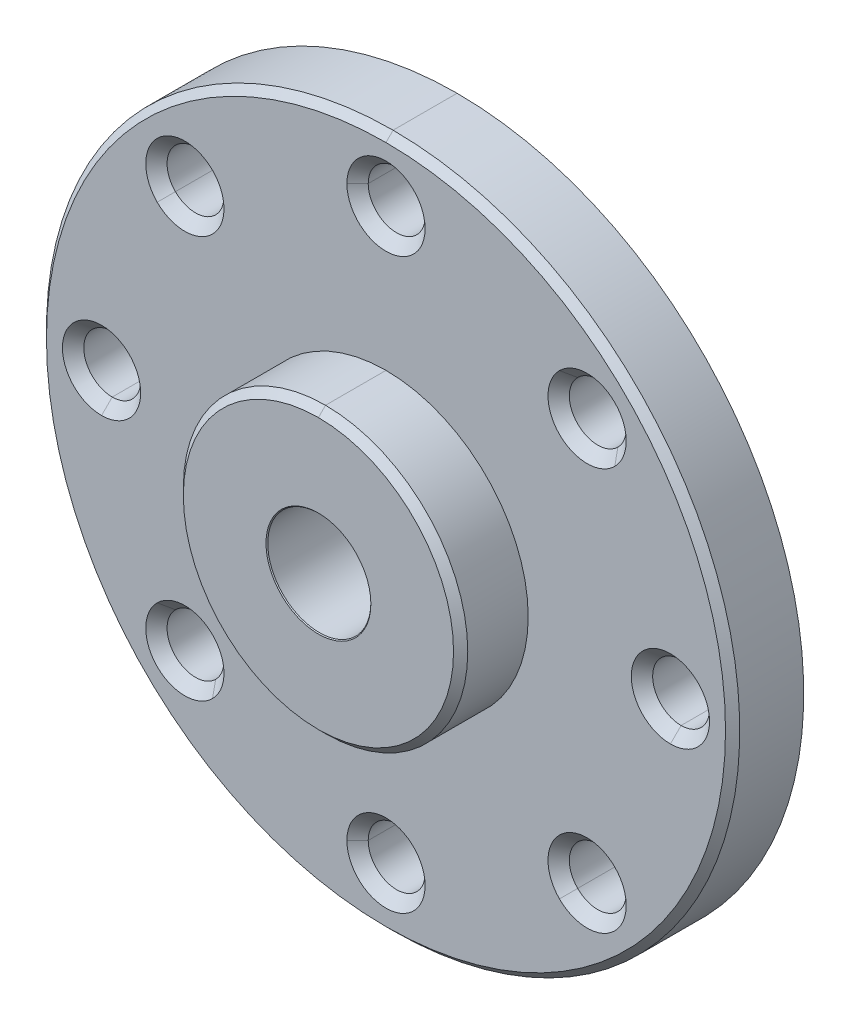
ISO-10303-21;
HEADER;
FILE_DESCRIPTION(('STEP AP214'),'2;1');
FILE_NAME('part.step','',(''),(''),'','','');
FILE_SCHEMA(('AUTOMOTIVE_DESIGN { 1 0 10303 214 1 1 1 1 }'));
ENDSEC;
DATA;
#1=APPLICATION_CONTEXT('core data for automotive mechanical design processes');
#2=APPLICATION_PROTOCOL_DEFINITION('international standard','automotive_design',2000,#1);
#3=PRODUCT_CONTEXT('',#1,'mechanical');
#4=PRODUCT('Part','Part','',(#3));
#5=PRODUCT_RELATED_PRODUCT_CATEGORY('part','',(#4));
#6=PRODUCT_DEFINITION_FORMATION('','',#4);
#7=PRODUCT_DEFINITION_CONTEXT('part definition',#1,'design');
#8=PRODUCT_DEFINITION('design','',#6,#7);
#9=PRODUCT_DEFINITION_SHAPE('','',#8);
#10=(LENGTH_UNIT() NAMED_UNIT(*) SI_UNIT(.MILLI.,.METRE.));
#11=(NAMED_UNIT(*) PLANE_ANGLE_UNIT() SI_UNIT($,.RADIAN.));
#12=(NAMED_UNIT(*) SI_UNIT($,.STERADIAN.) SOLID_ANGLE_UNIT());
#13=UNCERTAINTY_MEASURE_WITH_UNIT(LENGTH_MEASURE(1.E-05),#10,'distance_accuracy_value','');
#14=(GEOMETRIC_REPRESENTATION_CONTEXT(3) GLOBAL_UNCERTAINTY_ASSIGNED_CONTEXT((#13)) GLOBAL_UNIT_ASSIGNED_CONTEXT((#10,
#11,#12)) REPRESENTATION_CONTEXT('',''));
#15=CARTESIAN_POINT('',(0.,0.,0.));
#16=DIRECTION('',(0.,0.,1.));
#17=DIRECTION('',(1.,0.,0.));
#18=AXIS2_PLACEMENT_3D('',#15,#16,#17);
#19=CARTESIAN_POINT('',(0.,-3.799999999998,20.9));
#20=DIRECTION('',(0.,0.,1.));
#21=DIRECTION('',(1.,0.,0.));
#22=AXIS2_PLACEMENT_3D('',#19,#20,#21);
#23=PLANE('',#22);
#24=CARTESIAN_POINT('',(0.,0.,20.9));
#25=DIRECTION('',(0.,0.,1.));
#26=DIRECTION('',(1.,0.,0.));
#27=AXIS2_PLACEMENT_3D('',#24,#25,#26);
#28=CIRCLE('',#27,1.475);
#29=CARTESIAN_POINT('',(1.475,0.,20.9));
#30=VERTEX_POINT('',#29);
#31=EDGE_CURVE('E572',#30,#30,#28,.T.);
#32=ORIENTED_EDGE('',*,*,#31,.F.);
#33=EDGE_LOOP('',(#32));
#34=FACE_BOUND('',#33,.T.);
#35=CARTESIAN_POINT('',(0.,0.,20.9));
#36=DIRECTION('',(0.,0.,-1.));
#37=DIRECTION('',(0.,-1.,0.));
#38=AXIS2_PLACEMENT_3D('',#35,#36,#37);
#39=CIRCLE('',#38,3.799999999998);
#40=CARTESIAN_POINT('',(0.,-3.799999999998,20.9));
#41=VERTEX_POINT('',#40);
#42=CARTESIAN_POINT('',(0.,3.799999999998,20.9));
#43=VERTEX_POINT('',#42);
#44=EDGE_CURVE('E201',#41,#43,#39,.T.);
#45=ORIENTED_EDGE('',*,*,#44,.F.);
#46=CARTESIAN_POINT('',(0.,0.,20.9));
#47=DIRECTION('',(0.,0.,-1.));
#48=DIRECTION('',(0.,1.,0.));
#49=AXIS2_PLACEMENT_3D('',#46,#47,#48);
#50=CIRCLE('',#49,3.799999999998);
#51=EDGE_CURVE('E544',#43,#41,#50,.T.);
#52=ORIENTED_EDGE('',*,*,#51,.F.);
#53=EDGE_LOOP('',(#45,#52));
#54=FACE_BOUND('',#53,.T.);
#55=ADVANCED_FACE('F46',(#34,#54),#23,.T.);
#56=CARTESIAN_POINT('',(-13.85,9.08431457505,17.));
#57=DIRECTION('',(0.,0.,1.));
#58=DIRECTION('',(1.,0.,0.));
#59=AXIS2_PLACEMENT_3D('',#56,#57,#58);
#60=PLANE('',#59);
#61=CARTESIAN_POINT('',(0.,0.,17.));
#62=DIRECTION('',(0.,0.,1.));
#63=DIRECTION('',(1.,0.,0.));
#64=AXIS2_PLACEMENT_3D('',#61,#62,#63);
#65=CIRCLE('',#64,1.45);
#66=CARTESIAN_POINT('',(1.45,0.,17.));
#67=VERTEX_POINT('',#66);
#68=EDGE_CURVE('E49',#67,#67,#65,.T.);
#69=ORIENTED_EDGE('',*,*,#68,.T.);
#70=EDGE_LOOP('',(#69));
#71=FACE_BOUND('',#70,.T.);
#72=CARTESIAN_POINT('',(0.,0.,17.));
#73=DIRECTION('',(0.,0.,1.));
#74=DIRECTION('',(0.,-1.,0.));
#75=AXIS2_PLACEMENT_3D('',#72,#73,#74);
#76=CIRCLE('',#75,9.75);
#77=CARTESIAN_POINT('',(0.,-9.75,17.));
#78=VERTEX_POINT('',#77);
#79=CARTESIAN_POINT('',(0.,9.75,17.));
#80=VERTEX_POINT('',#79);
#81=EDGE_CURVE('E56',#78,#80,#76,.T.);
#82=ORIENTED_EDGE('',*,*,#81,.F.);
#83=CARTESIAN_POINT('',(0.,0.,17.));
#84=DIRECTION('',(0.,0.,1.));
#85=DIRECTION('',(0.,1.,0.));
#86=AXIS2_PLACEMENT_3D('',#83,#84,#85);
#87=CIRCLE('',#86,9.75);
#88=EDGE_CURVE('E11',#80,#78,#87,.T.);
#89=ORIENTED_EDGE('',*,*,#88,.F.);
#90=EDGE_LOOP('',(#82,#89));
#91=FACE_BOUND('',#90,.T.);
#92=CARTESIAN_POINT('',(0.,8.,17.));
#93=DIRECTION('',(0.,0.,-1.));
#94=DIRECTION('',(-1.,0.,0.));
#95=AXIS2_PLACEMENT_3D('',#92,#93,#94);
#96=CIRCLE('',#95,0.8);
#97=CARTESIAN_POINT('',(-0.8,8.,17.));
#98=VERTEX_POINT('',#97);
#99=CARTESIAN_POINT('',(0.8,8.,17.));
#100=VERTEX_POINT('',#99);
#101=EDGE_CURVE('E297',#98,#100,#96,.T.);
#102=ORIENTED_EDGE('',*,*,#101,.F.);
#103=CARTESIAN_POINT('',(0.,8.,17.));
#104=DIRECTION('',(0.,0.,-1.));
#105=DIRECTION('',(1.,0.,0.));
#106=AXIS2_PLACEMENT_3D('',#103,#104,#105);
#107=CIRCLE('',#106,0.8);
#108=EDGE_CURVE('E285',#100,#98,#107,.T.);
#109=ORIENTED_EDGE('',*,*,#108,.F.);
#110=EDGE_LOOP('',(#102,#109));
#111=FACE_BOUND('',#110,.T.);
#112=CARTESIAN_POINT('',(-5.656854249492,5.656854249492,17.));
#113=DIRECTION('',(0.,0.,-1.));
#114=DIRECTION('',(-0.707106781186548,-0.707106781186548,0.));
#115=AXIS2_PLACEMENT_3D('',#112,#113,#114);
#116=CIRCLE('',#115,0.8);
#117=CARTESIAN_POINT('',(-6.222539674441,5.091168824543,17.));
#118=VERTEX_POINT('',#117);
#119=CARTESIAN_POINT('',(-5.091168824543,6.222539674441,17.));
#120=VERTEX_POINT('',#119);
#121=EDGE_CURVE('E335',#118,#120,#116,.T.);
#122=ORIENTED_EDGE('',*,*,#121,.F.);
#123=CARTESIAN_POINT('',(-5.656854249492,5.656854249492,17.));
#124=DIRECTION('',(0.,0.,-1.));
#125=DIRECTION('',(0.707106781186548,0.707106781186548,0.));
#126=AXIS2_PLACEMENT_3D('',#123,#124,#125);
#127=CIRCLE('',#126,0.8);
#128=EDGE_CURVE('E340',#120,#118,#127,.T.);
#129=ORIENTED_EDGE('',*,*,#128,.F.);
#130=EDGE_LOOP('',(#122,#129));
#131=FACE_BOUND('',#130,.T.);
#132=CARTESIAN_POINT('',(-8.,0.,17.));
#133=DIRECTION('',(0.,0.,-1.));
#134=DIRECTION('',(0.,-1.,0.));
#135=AXIS2_PLACEMENT_3D('',#132,#133,#134);
#136=CIRCLE('',#135,0.8);
#137=CARTESIAN_POINT('',(-8.,-0.8,17.));
#138=VERTEX_POINT('',#137);
#139=CARTESIAN_POINT('',(-8.,0.8,17.));
#140=VERTEX_POINT('',#139);
#141=EDGE_CURVE('E389',#138,#140,#136,.T.);
#142=ORIENTED_EDGE('',*,*,#141,.F.);
#143=CARTESIAN_POINT('',(-8.,0.,17.));
#144=DIRECTION('',(0.,0.,-1.));
#145=DIRECTION('',(0.,1.,0.));
#146=AXIS2_PLACEMENT_3D('',#143,#144,#145);
#147=CIRCLE('',#146,0.8);
#148=EDGE_CURVE('E358',#140,#138,#147,.T.);
#149=ORIENTED_EDGE('',*,*,#148,.F.);
#150=EDGE_LOOP('',(#142,#149));
#151=FACE_BOUND('',#150,.T.);
#152=CARTESIAN_POINT('',(-5.656854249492,-5.656854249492,17.));
#153=DIRECTION('',(0.,0.,-1.));
#154=DIRECTION('',(0.707106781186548,-0.707106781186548,0.));
#155=AXIS2_PLACEMENT_3D('',#152,#153,#154);
#156=CIRCLE('',#155,0.8);
#157=CARTESIAN_POINT('',(-5.091168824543,-6.222539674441,17.));
#158=VERTEX_POINT('',#157);
#159=CARTESIAN_POINT('',(-6.222539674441,-5.091168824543,17.));
#160=VERTEX_POINT('',#159);
#161=EDGE_CURVE('E227',#158,#160,#156,.T.);
#162=ORIENTED_EDGE('',*,*,#161,.F.);
#163=CARTESIAN_POINT('',(-5.656854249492,-5.656854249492,17.));
#164=DIRECTION('',(0.,0.,-1.));
#165=DIRECTION('',(-0.707106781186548,0.707106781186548,0.));
#166=AXIS2_PLACEMENT_3D('',#163,#164,#165);
#167=CIRCLE('',#166,0.8);
#168=EDGE_CURVE('E223',#160,#158,#167,.T.);
#169=ORIENTED_EDGE('',*,*,#168,.F.);
#170=EDGE_LOOP('',(#162,#169));
#171=FACE_BOUND('',#170,.T.);
#172=CARTESIAN_POINT('',(0.,-8.,17.));
#173=DIRECTION('',(0.,0.,-1.));
#174=DIRECTION('',(1.,0.,0.));
#175=AXIS2_PLACEMENT_3D('',#172,#173,#174);
#176=CIRCLE('',#175,0.8);
#177=CARTESIAN_POINT('',(0.8,-8.,17.));
#178=VERTEX_POINT('',#177);
#179=CARTESIAN_POINT('',(-0.8,-8.,17.));
#180=VERTEX_POINT('',#179);
#181=EDGE_CURVE('E444',#178,#180,#176,.T.);
#182=ORIENTED_EDGE('',*,*,#181,.F.);
#183=CARTESIAN_POINT('',(0.,-8.,17.));
#184=DIRECTION('',(0.,0.,-1.));
#185=DIRECTION('',(-1.,0.,0.));
#186=AXIS2_PLACEMENT_3D('',#183,#184,#185);
#187=CIRCLE('',#186,0.8);
#188=EDGE_CURVE('E441',#180,#178,#187,.T.);
#189=ORIENTED_EDGE('',*,*,#188,.F.);
#190=EDGE_LOOP('',(#182,#189));
#191=FACE_BOUND('',#190,.T.);
#192=CARTESIAN_POINT('',(5.656854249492,-5.656854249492,17.));
#193=DIRECTION('',(0.,0.,-1.));
#194=DIRECTION('',(0.707106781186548,0.707106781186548,0.));
#195=AXIS2_PLACEMENT_3D('',#192,#193,#194);
#196=CIRCLE('',#195,0.8);
#197=CARTESIAN_POINT('',(6.222539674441,-5.091168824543,17.));
#198=VERTEX_POINT('',#197);
#199=CARTESIAN_POINT('',(5.091168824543,-6.222539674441,17.));
#200=VERTEX_POINT('',#199);
#201=EDGE_CURVE('E433',#198,#200,#196,.T.);
#202=ORIENTED_EDGE('',*,*,#201,.F.);
#203=CARTESIAN_POINT('',(5.656854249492,-5.656854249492,17.));
#204=DIRECTION('',(0.,0.,-1.));
#205=DIRECTION('',(-0.707106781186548,-0.707106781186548,0.));
#206=AXIS2_PLACEMENT_3D('',#203,#204,#205);
#207=CIRCLE('',#206,0.8);
#208=EDGE_CURVE('E430',#200,#198,#207,.T.);
#209=ORIENTED_EDGE('',*,*,#208,.F.);
#210=EDGE_LOOP('',(#202,#209));
#211=FACE_BOUND('',#210,.T.);
#212=CARTESIAN_POINT('',(8.,0.,17.));
#213=DIRECTION('',(0.,0.,-1.));
#214=DIRECTION('',(0.,1.,0.));
#215=AXIS2_PLACEMENT_3D('',#212,#213,#214);
#216=CIRCLE('',#215,0.8);
#217=CARTESIAN_POINT('',(8.,0.8,17.));
#218=VERTEX_POINT('',#217);
#219=CARTESIAN_POINT('',(8.,-0.8,17.));
#220=VERTEX_POINT('',#219);
#221=EDGE_CURVE('E401',#218,#220,#216,.T.);
#222=ORIENTED_EDGE('',*,*,#221,.F.);
#223=CARTESIAN_POINT('',(8.,0.,17.));
#224=DIRECTION('',(0.,0.,-1.));
#225=DIRECTION('',(0.,-1.,0.));
#226=AXIS2_PLACEMENT_3D('',#223,#224,#225);
#227=CIRCLE('',#226,0.8);
#228=EDGE_CURVE('E295',#220,#218,#227,.T.);
#229=ORIENTED_EDGE('',*,*,#228,.F.);
#230=EDGE_LOOP('',(#222,#229));
#231=FACE_BOUND('',#230,.T.);
#232=CARTESIAN_POINT('',(5.656854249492,5.656854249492,17.));
#233=DIRECTION('',(0.,0.,-1.));
#234=DIRECTION('',(-0.707106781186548,0.707106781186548,0.));
#235=AXIS2_PLACEMENT_3D('',#232,#233,#234);
#236=CIRCLE('',#235,0.8);
#237=CARTESIAN_POINT('',(5.091168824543,6.222539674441,17.));
#238=VERTEX_POINT('',#237);
#239=CARTESIAN_POINT('',(6.222539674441,5.091168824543,17.));
#240=VERTEX_POINT('',#239);
#241=EDGE_CURVE('E334',#238,#240,#236,.T.);
#242=ORIENTED_EDGE('',*,*,#241,.F.);
#243=CARTESIAN_POINT('',(5.656854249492,5.656854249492,17.));
#244=DIRECTION('',(0.,0.,-1.));
#245=DIRECTION('',(0.707106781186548,-0.707106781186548,0.));
#246=AXIS2_PLACEMENT_3D('',#243,#244,#245);
#247=CIRCLE('',#246,0.8);
#248=EDGE_CURVE('E484',#240,#238,#247,.T.);
#249=ORIENTED_EDGE('',*,*,#248,.F.);
#250=EDGE_LOOP('',(#242,#249));
#251=FACE_BOUND('',#250,.T.);
#252=ADVANCED_FACE('F225',(#71,#91,#111,#131,#151,#171,#191,#211,#231,#251),#60,.F.);
#253=CARTESIAN_POINT('',(0.,0.,21.35));
#254=DIRECTION('',(0.,0.,-1.));
#255=DIRECTION('',(0.,-1.,0.));
#256=AXIS2_PLACEMENT_3D('',#253,#254,#255);
#257=CYLINDRICAL_SURFACE('',#256,9.75);
#258=DIRECTION('',(0.,-1.42108547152E-13,-1.));
#259=VECTOR('',#258,1.);
#260=CARTESIAN_POINT('',(0.,-9.75,18.8));
#261=LINE('',#260,#259);
#262=CARTESIAN_POINT('',(0.,-9.749999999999,18.8));
#263=VERTEX_POINT('',#262);
#264=EDGE_CURVE('E276',#263,#78,#261,.T.);
#265=ORIENTED_EDGE('',*,*,#264,.T.);
#266=ORIENTED_EDGE('',*,*,#81,.T.);
#267=DIRECTION('',(-9.817297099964E-10,1.42108547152E-13,-1.));
#268=VECTOR('',#267,1.);
#269=CARTESIAN_POINT('',(2.946999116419E-09,9.75,18.8));
#270=LINE('',#269,#268);
#271=CARTESIAN_POINT('',(1.76982875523E-09,9.749999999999,18.8));
#272=VERTEX_POINT('',#271);
#273=EDGE_CURVE('E280',#272,#80,#270,.T.);
#274=ORIENTED_EDGE('',*,*,#273,.F.);
#275=CARTESIAN_POINT('',(0.,0.,18.8));
#276=DIRECTION('',(0.,0.,-1.));
#277=DIRECTION('',(1.815208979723E-10,1.,0.));
#278=AXIS2_PLACEMENT_3D('',#275,#276,#277);
#279=CIRCLE('',#278,9.749999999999);
#280=EDGE_CURVE('E407',#272,#263,#279,.T.);
#281=ORIENTED_EDGE('',*,*,#280,.T.);
#282=EDGE_LOOP('',(#265,#266,#274,#281));
#283=FACE_BOUND('',#282,.T.);
#284=ADVANCED_FACE('F688',(#283),#257,.T.);
#285=CARTESIAN_POINT('',(0.,0.,21.35));
#286=DIRECTION('',(0.,0.,-1.));
#287=DIRECTION('',(0.,-1.,0.));
#288=AXIS2_PLACEMENT_3D('',#285,#286,#287);
#289=CYLINDRICAL_SURFACE('',#288,9.75);
#290=ORIENTED_EDGE('',*,*,#273,.T.);
#291=ORIENTED_EDGE('',*,*,#88,.T.);
#292=ORIENTED_EDGE('',*,*,#264,.F.);
#293=CARTESIAN_POINT('',(0.,0.,18.8));
#294=DIRECTION('',(0.,0.,-1.));
#295=DIRECTION('',(0.,-1.,0.));
#296=AXIS2_PLACEMENT_3D('',#293,#294,#295);
#297=CIRCLE('',#296,9.749999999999);
#298=EDGE_CURVE('E387',#263,#272,#297,.T.);
#299=ORIENTED_EDGE('',*,*,#298,.T.);
#300=EDGE_LOOP('',(#290,#291,#292,#299));
#301=FACE_BOUND('',#300,.T.);
#302=ADVANCED_FACE('F687',(#301),#289,.T.);
#303=CARTESIAN_POINT('',(0.,8.,16.39527708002));
#304=DIRECTION('',(0.,0.,1.));
#305=DIRECTION('',(-1.,0.,0.));
#306=AXIS2_PLACEMENT_3D('',#303,#304,#305);
#307=CYLINDRICAL_SURFACE('',#306,0.8);
#308=DIRECTION('',(0.,0.,-1.));
#309=VECTOR('',#308,1.);
#310=CARTESIAN_POINT('',(-0.8,8.,18.7));
#311=LINE('',#310,#309);
#312=CARTESIAN_POINT('',(-0.8,8.,18.7));
#313=VERTEX_POINT('',#312);
#314=EDGE_CURVE('E301',#313,#98,#311,.T.);
#315=ORIENTED_EDGE('',*,*,#314,.F.);
#316=CARTESIAN_POINT('',(0.,8.,18.7));
#317=DIRECTION('',(0.,0.,1.));
#318=DIRECTION('',(-1.,0.,0.));
#319=AXIS2_PLACEMENT_3D('',#316,#317,#318);
#320=CIRCLE('',#319,0.8);
#321=CARTESIAN_POINT('',(0.8,8.,18.7));
#322=VERTEX_POINT('',#321);
#323=EDGE_CURVE('E388',#313,#322,#320,.T.);
#324=ORIENTED_EDGE('',*,*,#323,.T.);
#325=DIRECTION('',(0.,0.,-1.));
#326=VECTOR('',#325,1.);
#327=CARTESIAN_POINT('',(0.8,8.,18.7));
#328=LINE('',#327,#326);
#329=EDGE_CURVE('E275',#322,#100,#328,.T.);
#330=ORIENTED_EDGE('',*,*,#329,.T.);
#331=ORIENTED_EDGE('',*,*,#108,.T.);
#332=EDGE_LOOP('',(#315,#324,#330,#331));
#333=FACE_BOUND('',#332,.T.);
#334=ADVANCED_FACE('F804',(#333),#307,.F.);
#335=CARTESIAN_POINT('',(0.,8.,16.39527708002));
#336=DIRECTION('',(0.,0.,1.));
#337=DIRECTION('',(-1.,0.,0.));
#338=AXIS2_PLACEMENT_3D('',#335,#336,#337);
#339=CYLINDRICAL_SURFACE('',#338,0.8);
#340=ORIENTED_EDGE('',*,*,#329,.F.);
#341=CARTESIAN_POINT('',(0.,8.,18.7));
#342=DIRECTION('',(0.,0.,1.));
#343=DIRECTION('',(1.,0.,0.));
#344=AXIS2_PLACEMENT_3D('',#341,#342,#343);
#345=CIRCLE('',#344,0.8);
#346=EDGE_CURVE('E270',#322,#313,#345,.T.);
#347=ORIENTED_EDGE('',*,*,#346,.T.);
#348=ORIENTED_EDGE('',*,*,#314,.T.);
#349=ORIENTED_EDGE('',*,*,#101,.T.);
#350=EDGE_LOOP('',(#340,#347,#348,#349));
#351=FACE_BOUND('',#350,.T.);
#352=ADVANCED_FACE('F801',(#351),#339,.F.);
#353=CARTESIAN_POINT('',(-5.656854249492,5.656854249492,16.39527708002));
#354=DIRECTION('',(0.,0.,1.));
#355=DIRECTION('',(-0.707106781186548,-0.707106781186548,0.));
#356=AXIS2_PLACEMENT_3D('',#353,#354,#355);
#357=CYLINDRICAL_SURFACE('',#356,0.8);
#358=DIRECTION('',(0.,0.,-1.));
#359=VECTOR('',#358,1.);
#360=CARTESIAN_POINT('',(-6.222539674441,5.091168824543,18.7));
#361=LINE('',#360,#359);
#362=CARTESIAN_POINT('',(-6.222539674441,5.091168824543,18.7));
#363=VERTEX_POINT('',#362);
#364=EDGE_CURVE('E339',#363,#118,#361,.T.);
#365=ORIENTED_EDGE('',*,*,#364,.F.);
#366=CARTESIAN_POINT('',(-5.656854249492,5.656854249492,18.7));
#367=DIRECTION('',(0.,0.,1.));
#368=DIRECTION('',(-0.707106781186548,-0.707106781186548,0.));
#369=AXIS2_PLACEMENT_3D('',#366,#367,#368);
#370=CIRCLE('',#369,0.8);
#371=CARTESIAN_POINT('',(-5.091168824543,6.222539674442,18.7));
#372=VERTEX_POINT('',#371);
#373=EDGE_CURVE('E286',#363,#372,#370,.T.);
#374=ORIENTED_EDGE('',*,*,#373,.T.);
#375=DIRECTION('',(0.,0.,-1.));
#376=VECTOR('',#375,1.);
#377=CARTESIAN_POINT('',(-5.091168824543,6.222539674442,18.7));
#378=LINE('',#377,#376);
#379=EDGE_CURVE('E394',#372,#120,#378,.T.);
#380=ORIENTED_EDGE('',*,*,#379,.T.);
#381=ORIENTED_EDGE('',*,*,#128,.T.);
#382=EDGE_LOOP('',(#365,#374,#380,#381));
#383=FACE_BOUND('',#382,.T.);
#384=ADVANCED_FACE('F756',(#383),#357,.F.);
#385=CARTESIAN_POINT('',(-5.656854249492,5.656854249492,16.39527708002));
#386=DIRECTION('',(0.,0.,1.));
#387=DIRECTION('',(-0.707106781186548,-0.707106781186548,0.));
#388=AXIS2_PLACEMENT_3D('',#385,#386,#387);
#389=CYLINDRICAL_SURFACE('',#388,0.8);
#390=ORIENTED_EDGE('',*,*,#379,.F.);
#391=CARTESIAN_POINT('',(-5.656854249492,5.656854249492,18.7));
#392=DIRECTION('',(0.,0.,1.));
#393=DIRECTION('',(0.707106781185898,0.707106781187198,0.));
#394=AXIS2_PLACEMENT_3D('',#391,#392,#393);
#395=CIRCLE('',#394,0.8);
#396=EDGE_CURVE('E398',#372,#363,#395,.T.);
#397=ORIENTED_EDGE('',*,*,#396,.T.);
#398=ORIENTED_EDGE('',*,*,#364,.T.);
#399=ORIENTED_EDGE('',*,*,#121,.T.);
#400=EDGE_LOOP('',(#390,#397,#398,#399));
#401=FACE_BOUND('',#400,.T.);
#402=ADVANCED_FACE('F763',(#401),#389,.F.);
#403=CARTESIAN_POINT('',(-8.,0.,16.39527708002));
#404=DIRECTION('',(0.,0.,1.));
#405=DIRECTION('',(0.,-1.,0.));
#406=AXIS2_PLACEMENT_3D('',#403,#404,#405);
#407=CYLINDRICAL_SURFACE('',#406,0.8);
#408=DIRECTION('',(0.,0.,-1.));
#409=VECTOR('',#408,1.);
#410=CARTESIAN_POINT('',(-8.,-0.8,18.7));
#411=LINE('',#410,#409);
#412=CARTESIAN_POINT('',(-8.,-0.8,18.7));
#413=VERTEX_POINT('',#412);
#414=EDGE_CURVE('E393',#413,#138,#411,.T.);
#415=ORIENTED_EDGE('',*,*,#414,.F.);
#416=CARTESIAN_POINT('',(-8.,0.,18.7));
#417=DIRECTION('',(0.,0.,1.));
#418=DIRECTION('',(0.,-1.,0.));
#419=AXIS2_PLACEMENT_3D('',#416,#417,#418);
#420=CIRCLE('',#419,0.8);
#421=CARTESIAN_POINT('',(-8.,0.8,18.7));
#422=VERTEX_POINT('',#421);
#423=EDGE_CURVE('E262',#413,#422,#420,.T.);
#424=ORIENTED_EDGE('',*,*,#423,.T.);
#425=DIRECTION('',(0.,0.,-1.));
#426=VECTOR('',#425,1.);
#427=CARTESIAN_POINT('',(-8.,0.8,18.7));
#428=LINE('',#427,#426);
#429=EDGE_CURVE('E522',#422,#140,#428,.T.);
#430=ORIENTED_EDGE('',*,*,#429,.T.);
#431=ORIENTED_EDGE('',*,*,#148,.T.);
#432=EDGE_LOOP('',(#415,#424,#430,#431));
#433=FACE_BOUND('',#432,.T.);
#434=ADVANCED_FACE('F656',(#433),#407,.F.);
#435=CARTESIAN_POINT('',(-8.,0.,16.39527708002));
#436=DIRECTION('',(0.,0.,1.));
#437=DIRECTION('',(0.,-1.,0.));
#438=AXIS2_PLACEMENT_3D('',#435,#436,#437);
#439=CYLINDRICAL_SURFACE('',#438,0.8);
#440=ORIENTED_EDGE('',*,*,#429,.F.);
#441=CARTESIAN_POINT('',(-8.,0.,18.7));
#442=DIRECTION('',(0.,0.,1.));
#443=DIRECTION('',(0.,1.,0.));
#444=AXIS2_PLACEMENT_3D('',#441,#442,#443);
#445=CIRCLE('',#444,0.8);
#446=EDGE_CURVE('E263',#422,#413,#445,.T.);
#447=ORIENTED_EDGE('',*,*,#446,.T.);
#448=ORIENTED_EDGE('',*,*,#414,.T.);
#449=ORIENTED_EDGE('',*,*,#141,.T.);
#450=EDGE_LOOP('',(#440,#447,#448,#449));
#451=FACE_BOUND('',#450,.T.);
#452=ADVANCED_FACE('F661',(#451),#439,.F.);
#453=CARTESIAN_POINT('',(-5.656854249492,-5.656854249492,16.39527708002));
#454=DIRECTION('',(0.,0.,1.));
#455=DIRECTION('',(0.707106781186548,-0.707106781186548,0.));
#456=AXIS2_PLACEMENT_3D('',#453,#454,#455);
#457=CYLINDRICAL_SURFACE('',#456,0.8);
#458=DIRECTION('',(0.,0.,-1.));
#459=VECTOR('',#458,1.);
#460=CARTESIAN_POINT('',(-5.091168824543,-6.222539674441,18.7));
#461=LINE('',#460,#459);
#462=CARTESIAN_POINT('',(-5.091168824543,-6.222539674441,18.7));
#463=VERTEX_POINT('',#462);
#464=EDGE_CURVE('E239',#463,#158,#461,.T.);
#465=ORIENTED_EDGE('',*,*,#464,.F.);
#466=CARTESIAN_POINT('',(-5.656854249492,-5.656854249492,18.7));
#467=DIRECTION('',(0.,0.,1.));
#468=DIRECTION('',(0.707106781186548,-0.707106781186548,0.));
#469=AXIS2_PLACEMENT_3D('',#466,#467,#468);
#470=CIRCLE('',#469,0.8);
#471=CARTESIAN_POINT('',(-6.222539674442,-5.091168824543,18.7));
#472=VERTEX_POINT('',#471);
#473=EDGE_CURVE('E245',#463,#472,#470,.T.);
#474=ORIENTED_EDGE('',*,*,#473,.T.);
#475=DIRECTION('',(0.,0.,-1.));
#476=VECTOR('',#475,1.);
#477=CARTESIAN_POINT('',(-6.222539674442,-5.091168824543,18.7));
#478=LINE('',#477,#476);
#479=EDGE_CURVE('E237',#472,#160,#478,.T.);
#480=ORIENTED_EDGE('',*,*,#479,.T.);
#481=ORIENTED_EDGE('',*,*,#168,.T.);
#482=EDGE_LOOP('',(#465,#474,#480,#481));
#483=FACE_BOUND('',#482,.T.);
#484=ADVANCED_FACE('F243',(#483),#457,.F.);
#485=CARTESIAN_POINT('',(-5.656854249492,-5.656854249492,16.39527708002));
#486=DIRECTION('',(0.,0.,1.));
#487=DIRECTION('',(0.707106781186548,-0.707106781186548,0.));
#488=AXIS2_PLACEMENT_3D('',#485,#486,#487);
#489=CYLINDRICAL_SURFACE('',#488,0.8);
#490=ORIENTED_EDGE('',*,*,#479,.F.);
#491=CARTESIAN_POINT('',(-5.656854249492,-5.656854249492,18.7));
#492=DIRECTION('',(0.,0.,1.));
#493=DIRECTION('',(-0.707106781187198,0.707106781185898,0.));
#494=AXIS2_PLACEMENT_3D('',#491,#492,#493);
#495=CIRCLE('',#494,0.8);
#496=EDGE_CURVE('E248',#472,#463,#495,.T.);
#497=ORIENTED_EDGE('',*,*,#496,.T.);
#498=ORIENTED_EDGE('',*,*,#464,.T.);
#499=ORIENTED_EDGE('',*,*,#161,.T.);
#500=EDGE_LOOP('',(#490,#497,#498,#499));
#501=FACE_BOUND('',#500,.T.);
#502=ADVANCED_FACE('F235',(#501),#489,.F.);
#503=CARTESIAN_POINT('',(0.,-8.,16.39527708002));
#504=DIRECTION('',(0.,0.,1.));
#505=DIRECTION('',(1.,0.,0.));
#506=AXIS2_PLACEMENT_3D('',#503,#504,#505);
#507=CYLINDRICAL_SURFACE('',#506,0.8);
#508=DIRECTION('',(0.,0.,-1.));
#509=VECTOR('',#508,1.);
#510=CARTESIAN_POINT('',(0.8,-8.,18.7));
#511=LINE('',#510,#509);
#512=CARTESIAN_POINT('',(0.8,-8.,18.7));
#513=VERTEX_POINT('',#512);
#514=EDGE_CURVE('E483',#513,#178,#511,.T.);
#515=ORIENTED_EDGE('',*,*,#514,.F.);
#516=CARTESIAN_POINT('',(0.,-8.,18.7));
#517=DIRECTION('',(0.,0.,1.));
#518=DIRECTION('',(1.,0.,0.));
#519=AXIS2_PLACEMENT_3D('',#516,#517,#518);
#520=CIRCLE('',#519,0.8);
#521=CARTESIAN_POINT('',(-0.8,-8.,18.7));
#522=VERTEX_POINT('',#521);
#523=EDGE_CURVE('E318',#513,#522,#520,.T.);
#524=ORIENTED_EDGE('',*,*,#523,.T.);
#525=DIRECTION('',(0.,0.,-1.));
#526=VECTOR('',#525,1.);
#527=CARTESIAN_POINT('',(-0.8,-8.,18.7));
#528=LINE('',#527,#526);
#529=EDGE_CURVE('E504',#522,#180,#528,.T.);
#530=ORIENTED_EDGE('',*,*,#529,.T.);
#531=ORIENTED_EDGE('',*,*,#188,.T.);
#532=EDGE_LOOP('',(#515,#524,#530,#531));
#533=FACE_BOUND('',#532,.T.);
#534=ADVANCED_FACE('F799',(#533),#507,.F.);
#535=CARTESIAN_POINT('',(0.,-8.,16.39527708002));
#536=DIRECTION('',(0.,0.,1.));
#537=DIRECTION('',(1.,0.,0.));
#538=AXIS2_PLACEMENT_3D('',#535,#536,#537);
#539=CYLINDRICAL_SURFACE('',#538,0.8);
#540=ORIENTED_EDGE('',*,*,#529,.F.);
#541=CARTESIAN_POINT('',(0.,-8.,18.7));
#542=DIRECTION('',(0.,0.,1.));
#543=DIRECTION('',(-1.,0.,0.));
#544=AXIS2_PLACEMENT_3D('',#541,#542,#543);
#545=CIRCLE('',#544,0.8);
#546=EDGE_CURVE('E319',#522,#513,#545,.T.);
#547=ORIENTED_EDGE('',*,*,#546,.T.);
#548=ORIENTED_EDGE('',*,*,#514,.T.);
#549=ORIENTED_EDGE('',*,*,#181,.T.);
#550=EDGE_LOOP('',(#540,#547,#548,#549));
#551=FACE_BOUND('',#550,.T.);
#552=ADVANCED_FACE('F796',(#551),#539,.F.);
#553=CARTESIAN_POINT('',(5.656854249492,-5.656854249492,16.39527708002));
#554=DIRECTION('',(0.,0.,1.));
#555=DIRECTION('',(0.707106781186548,0.707106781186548,0.));
#556=AXIS2_PLACEMENT_3D('',#553,#554,#555);
#557=CYLINDRICAL_SURFACE('',#556,0.8);
#558=DIRECTION('',(0.,0.,-1.));
#559=VECTOR('',#558,1.);
#560=CARTESIAN_POINT('',(6.222539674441,-5.091168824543,18.7));
#561=LINE('',#560,#559);
#562=CARTESIAN_POINT('',(6.222539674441,-5.091168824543,18.7));
#563=VERTEX_POINT('',#562);
#564=EDGE_CURVE('E307',#563,#198,#561,.T.);
#565=ORIENTED_EDGE('',*,*,#564,.F.);
#566=CARTESIAN_POINT('',(5.656854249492,-5.656854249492,18.7));
#567=DIRECTION('',(0.,0.,1.));
#568=DIRECTION('',(0.707106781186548,0.707106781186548,0.));
#569=AXIS2_PLACEMENT_3D('',#566,#567,#568);
#570=CIRCLE('',#569,0.8);
#571=CARTESIAN_POINT('',(5.091168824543,-6.222539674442,18.7));
#572=VERTEX_POINT('',#571);
#573=EDGE_CURVE('E458',#563,#572,#570,.T.);
#574=ORIENTED_EDGE('',*,*,#573,.T.);
#575=DIRECTION('',(0.,0.,-1.));
#576=VECTOR('',#575,1.);
#577=CARTESIAN_POINT('',(5.091168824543,-6.222539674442,18.7));
#578=LINE('',#577,#576);
#579=EDGE_CURVE('E302',#572,#200,#578,.T.);
#580=ORIENTED_EDGE('',*,*,#579,.T.);
#581=ORIENTED_EDGE('',*,*,#208,.T.);
#582=EDGE_LOOP('',(#565,#574,#580,#581));
#583=FACE_BOUND('',#582,.T.);
#584=ADVANCED_FACE('F714',(#583),#557,.F.);
#585=CARTESIAN_POINT('',(5.656854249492,-5.656854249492,16.39527708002));
#586=DIRECTION('',(0.,0.,1.));
#587=DIRECTION('',(0.707106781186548,0.707106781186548,0.));
#588=AXIS2_PLACEMENT_3D('',#585,#586,#587);
#589=CYLINDRICAL_SURFACE('',#588,0.8);
#590=ORIENTED_EDGE('',*,*,#579,.F.);
#591=CARTESIAN_POINT('',(5.656854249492,-5.656854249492,18.7));
#592=DIRECTION('',(0.,0.,1.));
#593=DIRECTION('',(-0.707106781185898,-0.707106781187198,0.));
#594=AXIS2_PLACEMENT_3D('',#591,#592,#593);
#595=CIRCLE('',#594,0.8);
#596=EDGE_CURVE('E306',#572,#563,#595,.T.);
#597=ORIENTED_EDGE('',*,*,#596,.T.);
#598=ORIENTED_EDGE('',*,*,#564,.T.);
#599=ORIENTED_EDGE('',*,*,#201,.T.);
#600=EDGE_LOOP('',(#590,#597,#598,#599));
#601=FACE_BOUND('',#600,.T.);
#602=ADVANCED_FACE('F716',(#601),#589,.F.);
#603=CARTESIAN_POINT('',(8.,0.,16.39527708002));
#604=DIRECTION('',(0.,0.,1.));
#605=DIRECTION('',(0.,1.,0.));
#606=AXIS2_PLACEMENT_3D('',#603,#604,#605);
#607=CYLINDRICAL_SURFACE('',#606,0.8);
#608=DIRECTION('',(0.,0.,-1.));
#609=VECTOR('',#608,1.);
#610=CARTESIAN_POINT('',(8.,0.8,18.7));
#611=LINE('',#610,#609);
#612=CARTESIAN_POINT('',(8.,0.8,18.7));
#613=VERTEX_POINT('',#612);
#614=EDGE_CURVE('E491',#613,#218,#611,.T.);
#615=ORIENTED_EDGE('',*,*,#614,.F.);
#616=CARTESIAN_POINT('',(8.,0.,18.7));
#617=DIRECTION('',(0.,0.,1.));
#618=DIRECTION('',(0.,1.,0.));
#619=AXIS2_PLACEMENT_3D('',#616,#617,#618);
#620=CIRCLE('',#619,0.8);
#621=CARTESIAN_POINT('',(8.,-0.8,18.7));
#622=VERTEX_POINT('',#621);
#623=EDGE_CURVE('E350',#613,#622,#620,.T.);
#624=ORIENTED_EDGE('',*,*,#623,.T.);
#625=DIRECTION('',(0.,0.,-1.));
#626=VECTOR('',#625,1.);
#627=CARTESIAN_POINT('',(8.,-0.8,18.7));
#628=LINE('',#627,#626);
#629=EDGE_CURVE('E479',#622,#220,#628,.T.);
#630=ORIENTED_EDGE('',*,*,#629,.T.);
#631=ORIENTED_EDGE('',*,*,#228,.T.);
#632=EDGE_LOOP('',(#615,#624,#630,#631));
#633=FACE_BOUND('',#632,.T.);
#634=ADVANCED_FACE('F744',(#633),#607,.F.);
#635=CARTESIAN_POINT('',(8.,0.,16.39527708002));
#636=DIRECTION('',(0.,0.,1.));
#637=DIRECTION('',(0.,1.,0.));
#638=AXIS2_PLACEMENT_3D('',#635,#636,#637);
#639=CYLINDRICAL_SURFACE('',#638,0.8);
#640=ORIENTED_EDGE('',*,*,#629,.F.);
#641=CARTESIAN_POINT('',(8.,0.,18.7));
#642=DIRECTION('',(0.,0.,1.));
#643=DIRECTION('',(0.,-1.,0.));
#644=AXIS2_PLACEMENT_3D('',#641,#642,#643);
#645=CIRCLE('',#644,0.8);
#646=EDGE_CURVE('E429',#622,#613,#645,.T.);
#647=ORIENTED_EDGE('',*,*,#646,.T.);
#648=ORIENTED_EDGE('',*,*,#614,.T.);
#649=ORIENTED_EDGE('',*,*,#221,.T.);
#650=EDGE_LOOP('',(#640,#647,#648,#649));
#651=FACE_BOUND('',#650,.T.);
#652=ADVANCED_FACE('F746',(#651),#639,.F.);
#653=CARTESIAN_POINT('',(5.656854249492,5.656854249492,16.39527708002));
#654=DIRECTION('',(0.,0.,1.));
#655=DIRECTION('',(-0.707106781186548,0.707106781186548,0.));
#656=AXIS2_PLACEMENT_3D('',#653,#654,#655);
#657=CYLINDRICAL_SURFACE('',#656,0.8);
#658=DIRECTION('',(0.,0.,-1.));
#659=VECTOR('',#658,1.);
#660=CARTESIAN_POINT('',(5.091168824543,6.222539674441,18.7));
#661=LINE('',#660,#659);
#662=CARTESIAN_POINT('',(5.091168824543,6.222539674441,18.7));
#663=VERTEX_POINT('',#662);
#664=EDGE_CURVE('E330',#663,#238,#661,.T.);
#665=ORIENTED_EDGE('',*,*,#664,.F.);
#666=CARTESIAN_POINT('',(5.656854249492,5.656854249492,18.7));
#667=DIRECTION('',(0.,0.,1.));
#668=DIRECTION('',(-0.707106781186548,0.707106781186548,0.));
#669=AXIS2_PLACEMENT_3D('',#666,#667,#668);
#670=CIRCLE('',#669,0.8);
#671=CARTESIAN_POINT('',(6.222539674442,5.091168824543,18.7));
#672=VERTEX_POINT('',#671);
#673=EDGE_CURVE('E296',#663,#672,#670,.T.);
#674=ORIENTED_EDGE('',*,*,#673,.T.);
#675=DIRECTION('',(0.,0.,-1.));
#676=VECTOR('',#675,1.);
#677=CARTESIAN_POINT('',(6.222539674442,5.091168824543,18.7));
#678=LINE('',#677,#676);
#679=EDGE_CURVE('E313',#672,#240,#678,.T.);
#680=ORIENTED_EDGE('',*,*,#679,.T.);
#681=ORIENTED_EDGE('',*,*,#248,.T.);
#682=EDGE_LOOP('',(#665,#674,#680,#681));
#683=FACE_BOUND('',#682,.T.);
#684=ADVANCED_FACE('F726',(#683),#657,.F.);
#685=CARTESIAN_POINT('',(5.656854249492,5.656854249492,16.39527708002));
#686=DIRECTION('',(0.,0.,1.));
#687=DIRECTION('',(-0.707106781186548,0.707106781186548,0.));
#688=AXIS2_PLACEMENT_3D('',#685,#686,#687);
#689=CYLINDRICAL_SURFACE('',#688,0.8);
#690=ORIENTED_EDGE('',*,*,#679,.F.);
#691=CARTESIAN_POINT('',(5.656854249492,5.656854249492,18.7));
#692=DIRECTION('',(0.,0.,1.));
#693=DIRECTION('',(0.707106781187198,-0.707106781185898,0.));
#694=AXIS2_PLACEMENT_3D('',#691,#692,#693);
#695=CIRCLE('',#694,0.8);
#696=EDGE_CURVE('E308',#672,#663,#695,.T.);
#697=ORIENTED_EDGE('',*,*,#696,.T.);
#698=ORIENTED_EDGE('',*,*,#664,.T.);
#699=ORIENTED_EDGE('',*,*,#241,.T.);
#700=EDGE_LOOP('',(#690,#697,#698,#699));
#701=FACE_BOUND('',#700,.T.);
#702=ADVANCED_FACE('F723',(#701),#689,.F.);
#703=CARTESIAN_POINT('',(0.,0.,18.9));
#704=DIRECTION('',(0.,0.,-1.));
#705=DIRECTION('',(0.,-1.,0.));
#706=AXIS2_PLACEMENT_3D('',#703,#704,#705);
#707=CONICAL_SURFACE('',#706,9.649999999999,0.7853981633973);
#708=DIRECTION('',(0.,0.707106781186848,0.707106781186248));
#709=VECTOR('',#708,1.);
#710=CARTESIAN_POINT('',(0.,-9.75,18.8));
#711=LINE('',#710,#709);
#712=CARTESIAN_POINT('',(0.,-9.549999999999,19.));
#713=VERTEX_POINT('',#712);
#714=EDGE_CURVE('E370',#263,#713,#711,.T.);
#715=ORIENTED_EDGE('',*,*,#714,.F.);
#716=ORIENTED_EDGE('',*,*,#280,.F.);
#717=DIRECTION('',(-8.9785913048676E-10,-0.707106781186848,0.707106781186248));
#718=VECTOR('',#717,1.);
#719=CARTESIAN_POINT('',(2.946999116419E-09,9.75,18.8));
#720=LINE('',#719,#718);
#721=CARTESIAN_POINT('',(0.,9.549999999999,19.));
#722=VERTEX_POINT('',#721);
#723=EDGE_CURVE('E366',#272,#722,#720,.T.);
#724=ORIENTED_EDGE('',*,*,#723,.T.);
#725=CARTESIAN_POINT('',(0.,0.,19.));
#726=DIRECTION('',(0.,0.,-1.));
#727=DIRECTION('',(0.,1.,0.));
#728=AXIS2_PLACEMENT_3D('',#725,#726,#727);
#729=CIRCLE('',#728,9.549999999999);
#730=EDGE_CURVE('E371',#722,#713,#729,.T.);
#731=ORIENTED_EDGE('',*,*,#730,.T.);
#732=EDGE_LOOP('',(#715,#716,#724,#731));
#733=FACE_BOUND('',#732,.T.);
#734=ADVANCED_FACE('F684',(#733),#707,.T.);
#735=CARTESIAN_POINT('',(0.,0.,18.9));
#736=DIRECTION('',(0.,0.,-1.));
#737=DIRECTION('',(0.,-1.,0.));
#738=AXIS2_PLACEMENT_3D('',#735,#736,#737);
#739=CONICAL_SURFACE('',#738,9.649999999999,0.7853981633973);
#740=ORIENTED_EDGE('',*,*,#723,.F.);
#741=ORIENTED_EDGE('',*,*,#298,.F.);
#742=ORIENTED_EDGE('',*,*,#714,.T.);
#743=CARTESIAN_POINT('',(0.,0.,19.));
#744=DIRECTION('',(0.,0.,-1.));
#745=DIRECTION('',(0.,-1.,0.));
#746=AXIS2_PLACEMENT_3D('',#743,#744,#745);
#747=CIRCLE('',#746,9.549999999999);
#748=EDGE_CURVE('E546',#713,#722,#747,.T.);
#749=ORIENTED_EDGE('',*,*,#748,.T.);
#750=EDGE_LOOP('',(#740,#741,#742,#749));
#751=FACE_BOUND('',#750,.T.);
#752=ADVANCED_FACE('F685',(#751),#739,.T.);
#753=CARTESIAN_POINT('',(0.,8.,18.85));
#754=DIRECTION('',(0.,0.,1.));
#755=DIRECTION('',(-1.,0.,0.));
#756=AXIS2_PLACEMENT_3D('',#753,#754,#755);
#757=CONICAL_SURFACE('',#756,0.95,0.7853981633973);
#758=DIRECTION('',(-0.707106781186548,0.,-0.707106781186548));
#759=VECTOR('',#758,1.);
#760=CARTESIAN_POINT('',(1.1,8.,19.));
#761=LINE('',#760,#759);
#762=CARTESIAN_POINT('',(1.1,8.,19.));
#763=VERTEX_POINT('',#762);
#764=EDGE_CURVE('E383',#763,#322,#761,.T.);
#765=ORIENTED_EDGE('',*,*,#764,.T.);
#766=ORIENTED_EDGE('',*,*,#323,.F.);
#767=DIRECTION('',(0.707106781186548,0.,-0.707106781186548));
#768=VECTOR('',#767,1.);
#769=CARTESIAN_POINT('',(-1.1,8.,19.));
#770=LINE('',#769,#768);
#771=CARTESIAN_POINT('',(-1.1,8.,19.));
#772=VERTEX_POINT('',#771);
#773=EDGE_CURVE('E274',#772,#313,#770,.T.);
#774=ORIENTED_EDGE('',*,*,#773,.F.);
#775=CARTESIAN_POINT('',(0.,8.,19.));
#776=DIRECTION('',(0.,0.,1.));
#777=DIRECTION('',(-1.,0.,0.));
#778=AXIS2_PLACEMENT_3D('',#775,#776,#777);
#779=CIRCLE('',#778,1.1);
#780=EDGE_CURVE('E533',#772,#763,#779,.T.);
#781=ORIENTED_EDGE('',*,*,#780,.T.);
#782=EDGE_LOOP('',(#765,#766,#774,#781));
#783=FACE_BOUND('',#782,.T.);
#784=ADVANCED_FACE('F778',(#783),#757,.F.);
#785=CARTESIAN_POINT('',(0.,8.,18.85));
#786=DIRECTION('',(0.,0.,1.));
#787=DIRECTION('',(-1.,0.,0.));
#788=AXIS2_PLACEMENT_3D('',#785,#786,#787);
#789=CONICAL_SURFACE('',#788,0.95,0.7853981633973);
#790=ORIENTED_EDGE('',*,*,#773,.T.);
#791=ORIENTED_EDGE('',*,*,#346,.F.);
#792=ORIENTED_EDGE('',*,*,#764,.F.);
#793=CARTESIAN_POINT('',(0.,8.,19.));
#794=DIRECTION('',(0.,0.,1.));
#795=DIRECTION('',(1.,0.,0.));
#796=AXIS2_PLACEMENT_3D('',#793,#794,#795);
#797=CIRCLE('',#796,1.1);
#798=EDGE_CURVE('E538',#763,#772,#797,.T.);
#799=ORIENTED_EDGE('',*,*,#798,.T.);
#800=EDGE_LOOP('',(#790,#791,#792,#799));
#801=FACE_BOUND('',#800,.T.);
#802=ADVANCED_FACE('F774',(#801),#789,.F.);
#803=CARTESIAN_POINT('',(-5.656854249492,5.656854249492,18.85));
#804=DIRECTION('',(0.,0.,1.));
#805=DIRECTION('',(-0.707106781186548,-0.707106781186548,0.));
#806=AXIS2_PLACEMENT_3D('',#803,#804,#805);
#807=CONICAL_SURFACE('',#806,0.95,0.7853981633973);
#808=DIRECTION('',(-0.500000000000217,-0.499999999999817,-0.707106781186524));
#809=VECTOR('',#808,1.);
#810=CARTESIAN_POINT('',(-4.879036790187,6.434671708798,19.));
#811=LINE('',#810,#809);
#812=CARTESIAN_POINT('',(-4.879036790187,6.434671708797,19.));
#813=VERTEX_POINT('',#812);
#814=EDGE_CURVE('E281',#813,#372,#811,.T.);
#815=ORIENTED_EDGE('',*,*,#814,.T.);
#816=ORIENTED_EDGE('',*,*,#373,.F.);
#817=DIRECTION('',(0.500000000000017,0.500000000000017,-0.707106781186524));
#818=VECTOR('',#817,1.);
#819=CARTESIAN_POINT('',(-6.434671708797,4.879036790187,19.));
#820=LINE('',#819,#818);
#821=CARTESIAN_POINT('',(-6.434671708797,4.879036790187,19.));
#822=VERTEX_POINT('',#821);
#823=EDGE_CURVE('E437',#822,#363,#820,.T.);
#824=ORIENTED_EDGE('',*,*,#823,.F.);
#825=CARTESIAN_POINT('',(-5.656854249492,5.656854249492,19.));
#826=DIRECTION('',(0.,0.,1.));
#827=DIRECTION('',(-0.707106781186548,-0.707106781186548,0.));
#828=AXIS2_PLACEMENT_3D('',#825,#826,#827);
#829=CIRCLE('',#828,1.1);
#830=EDGE_CURVE('E534',#822,#813,#829,.T.);
#831=ORIENTED_EDGE('',*,*,#830,.T.);
#832=EDGE_LOOP('',(#815,#816,#824,#831));
#833=FACE_BOUND('',#832,.T.);
#834=ADVANCED_FACE('F777',(#833),#807,.F.);
#835=CARTESIAN_POINT('',(-5.656854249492,5.656854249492,18.85));
#836=DIRECTION('',(0.,0.,1.));
#837=DIRECTION('',(-0.707106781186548,-0.707106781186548,0.));
#838=AXIS2_PLACEMENT_3D('',#835,#836,#837);
#839=CONICAL_SURFACE('',#838,0.95,0.7853981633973);
#840=ORIENTED_EDGE('',*,*,#823,.T.);
#841=ORIENTED_EDGE('',*,*,#396,.F.);
#842=ORIENTED_EDGE('',*,*,#814,.F.);
#843=CARTESIAN_POINT('',(-5.656854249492,5.656854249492,19.));
#844=DIRECTION('',(0.,0.,1.));
#845=DIRECTION('',(0.707106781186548,0.707106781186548,0.));
#846=AXIS2_PLACEMENT_3D('',#843,#844,#845);
#847=CIRCLE('',#846,1.1);
#848=EDGE_CURVE('E529',#813,#822,#847,.T.);
#849=ORIENTED_EDGE('',*,*,#848,.T.);
#850=EDGE_LOOP('',(#840,#841,#842,#849));
#851=FACE_BOUND('',#850,.T.);
#852=ADVANCED_FACE('F808',(#851),#839,.F.);
#853=CARTESIAN_POINT('',(-8.,0.,18.85));
#854=DIRECTION('',(0.,0.,1.));
#855=DIRECTION('',(0.,-1.,0.));
#856=AXIS2_PLACEMENT_3D('',#853,#854,#855);
#857=CONICAL_SURFACE('',#856,0.95,0.7853981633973);
#858=DIRECTION('',(0.,-0.707106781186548,-0.707106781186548));
#859=VECTOR('',#858,1.);
#860=CARTESIAN_POINT('',(-8.,1.1,19.));
#861=LINE('',#860,#859);
#862=CARTESIAN_POINT('',(-8.,1.1,19.));
#863=VERTEX_POINT('',#862);
#864=EDGE_CURVE('E290',#863,#422,#861,.T.);
#865=ORIENTED_EDGE('',*,*,#864,.T.);
#866=ORIENTED_EDGE('',*,*,#423,.F.);
#867=DIRECTION('',(0.,0.707106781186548,-0.707106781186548));
#868=VECTOR('',#867,1.);
#869=CARTESIAN_POINT('',(-8.,-1.1,19.));
#870=LINE('',#869,#868);
#871=CARTESIAN_POINT('',(-8.,-1.1,19.));
#872=VERTEX_POINT('',#871);
#873=EDGE_CURVE('E258',#872,#413,#870,.T.);
#874=ORIENTED_EDGE('',*,*,#873,.F.);
#875=CARTESIAN_POINT('',(-8.,0.,19.));
#876=DIRECTION('',(0.,0.,1.));
#877=DIRECTION('',(0.,-1.,0.));
#878=AXIS2_PLACEMENT_3D('',#875,#876,#877);
#879=CIRCLE('',#878,1.1);
#880=EDGE_CURVE('E360',#872,#863,#879,.T.);
#881=ORIENTED_EDGE('',*,*,#880,.T.);
#882=EDGE_LOOP('',(#865,#866,#874,#881));
#883=FACE_BOUND('',#882,.T.);
#884=ADVANCED_FACE('F667',(#883),#857,.F.);
#885=CARTESIAN_POINT('',(-8.,0.,18.85));
#886=DIRECTION('',(0.,0.,1.));
#887=DIRECTION('',(0.,-1.,0.));
#888=AXIS2_PLACEMENT_3D('',#885,#886,#887);
#889=CONICAL_SURFACE('',#888,0.95,0.7853981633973);
#890=ORIENTED_EDGE('',*,*,#873,.T.);
#891=ORIENTED_EDGE('',*,*,#446,.F.);
#892=ORIENTED_EDGE('',*,*,#864,.F.);
#893=CARTESIAN_POINT('',(-8.,0.,19.));
#894=DIRECTION('',(0.,0.,1.));
#895=DIRECTION('',(0.,1.,0.));
#896=AXIS2_PLACEMENT_3D('',#893,#894,#895);
#897=CIRCLE('',#896,1.1);
#898=EDGE_CURVE('E364',#863,#872,#897,.T.);
#899=ORIENTED_EDGE('',*,*,#898,.T.);
#900=EDGE_LOOP('',(#890,#891,#892,#899));
#901=FACE_BOUND('',#900,.T.);
#902=ADVANCED_FACE('F663',(#901),#889,.F.);
#903=CARTESIAN_POINT('',(-5.656854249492,-5.656854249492,18.85));
#904=DIRECTION('',(0.,0.,1.));
#905=DIRECTION('',(0.707106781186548,-0.707106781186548,0.));
#906=AXIS2_PLACEMENT_3D('',#903,#904,#905);
#907=CONICAL_SURFACE('',#906,0.95,0.7853981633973);
#908=DIRECTION('',(0.499999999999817,-0.500000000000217,-0.707106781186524));
#909=VECTOR('',#908,1.);
#910=CARTESIAN_POINT('',(-6.434671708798,-4.879036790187,19.));
#911=LINE('',#910,#909);
#912=CARTESIAN_POINT('',(-6.434671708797,-4.879036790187,19.));
#913=VERTEX_POINT('',#912);
#914=EDGE_CURVE('E356',#913,#472,#911,.T.);
#915=ORIENTED_EDGE('',*,*,#914,.T.);
#916=ORIENTED_EDGE('',*,*,#473,.F.);
#917=DIRECTION('',(-0.500000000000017,0.500000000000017,-0.707106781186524));
#918=VECTOR('',#917,1.);
#919=CARTESIAN_POINT('',(-4.879036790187,-6.434671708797,19.));
#920=LINE('',#919,#918);
#921=CARTESIAN_POINT('',(-4.879036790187,-6.434671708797,19.));
#922=VERTEX_POINT('',#921);
#923=EDGE_CURVE('E252',#922,#463,#920,.T.);
#924=ORIENTED_EDGE('',*,*,#923,.F.);
#925=CARTESIAN_POINT('',(-5.656854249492,-5.656854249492,19.));
#926=DIRECTION('',(0.,0.,1.));
#927=DIRECTION('',(0.707106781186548,-0.707106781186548,0.));
#928=AXIS2_PLACEMENT_3D('',#925,#926,#927);
#929=CIRCLE('',#928,1.1);
#930=EDGE_CURVE('E375',#922,#913,#929,.T.);
#931=ORIENTED_EDGE('',*,*,#930,.T.);
#932=EDGE_LOOP('',(#915,#916,#924,#931));
#933=FACE_BOUND('',#932,.T.);
#934=ADVANCED_FACE('F789',(#933),#907,.F.);
#935=CARTESIAN_POINT('',(-5.656854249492,-5.656854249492,18.85));
#936=DIRECTION('',(0.,0.,1.));
#937=DIRECTION('',(0.707106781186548,-0.707106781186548,0.));
#938=AXIS2_PLACEMENT_3D('',#935,#936,#937);
#939=CONICAL_SURFACE('',#938,0.95,0.7853981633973);
#940=ORIENTED_EDGE('',*,*,#923,.T.);
#941=ORIENTED_EDGE('',*,*,#496,.F.);
#942=ORIENTED_EDGE('',*,*,#914,.F.);
#943=CARTESIAN_POINT('',(-5.656854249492,-5.656854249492,19.));
#944=DIRECTION('',(0.,0.,1.));
#945=DIRECTION('',(-0.707106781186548,0.707106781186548,0.));
#946=AXIS2_PLACEMENT_3D('',#943,#944,#945);
#947=CIRCLE('',#946,1.1);
#948=EDGE_CURVE('E365',#913,#922,#947,.T.);
#949=ORIENTED_EDGE('',*,*,#948,.T.);
#950=EDGE_LOOP('',(#940,#941,#942,#949));
#951=FACE_BOUND('',#950,.T.);
#952=ADVANCED_FACE('F786',(#951),#939,.F.);
#953=CARTESIAN_POINT('',(0.,-8.,18.85));
#954=DIRECTION('',(0.,0.,1.));
#955=DIRECTION('',(1.,0.,0.));
#956=AXIS2_PLACEMENT_3D('',#953,#954,#955);
#957=CONICAL_SURFACE('',#956,0.95,0.7853981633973);
#958=DIRECTION('',(0.707106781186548,0.,-0.707106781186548));
#959=VECTOR('',#958,1.);
#960=CARTESIAN_POINT('',(-1.1,-8.,19.));
#961=LINE('',#960,#959);
#962=CARTESIAN_POINT('',(-1.1,-8.,19.));
#963=VERTEX_POINT('',#962);
#964=EDGE_CURVE('E232',#963,#522,#961,.T.);
#965=ORIENTED_EDGE('',*,*,#964,.T.);
#966=ORIENTED_EDGE('',*,*,#523,.F.);
#967=DIRECTION('',(-0.707106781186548,0.,-0.707106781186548));
#968=VECTOR('',#967,1.);
#969=CARTESIAN_POINT('',(1.1,-8.,19.));
#970=LINE('',#969,#968);
#971=CARTESIAN_POINT('',(1.1,-8.,19.));
#972=VERTEX_POINT('',#971);
#973=EDGE_CURVE('E314',#972,#513,#970,.T.);
#974=ORIENTED_EDGE('',*,*,#973,.F.);
#975=CARTESIAN_POINT('',(0.,-8.,19.));
#976=DIRECTION('',(0.,0.,1.));
#977=DIRECTION('',(1.,0.,0.));
#978=AXIS2_PLACEMENT_3D('',#975,#976,#977);
#979=CIRCLE('',#978,1.1);
#980=EDGE_CURVE('E320',#972,#963,#979,.T.);
#981=ORIENTED_EDGE('',*,*,#980,.T.);
#982=EDGE_LOOP('',(#965,#966,#974,#981));
#983=FACE_BOUND('',#982,.T.);
#984=ADVANCED_FACE('F770',(#983),#957,.F.);
#985=CARTESIAN_POINT('',(0.,-8.,18.85));
#986=DIRECTION('',(0.,0.,1.));
#987=DIRECTION('',(1.,0.,0.));
#988=AXIS2_PLACEMENT_3D('',#985,#986,#987);
#989=CONICAL_SURFACE('',#988,0.95,0.7853981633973);
#990=ORIENTED_EDGE('',*,*,#973,.T.);
#991=ORIENTED_EDGE('',*,*,#546,.F.);
#992=ORIENTED_EDGE('',*,*,#964,.F.);
#993=CARTESIAN_POINT('',(0.,-8.,19.));
#994=DIRECTION('',(0.,0.,1.));
#995=DIRECTION('',(-1.,0.,0.));
#996=AXIS2_PLACEMENT_3D('',#993,#994,#995);
#997=CIRCLE('',#996,1.1);
#998=EDGE_CURVE('E324',#963,#972,#997,.T.);
#999=ORIENTED_EDGE('',*,*,#998,.T.);
#1000=EDGE_LOOP('',(#990,#991,#992,#999));
#1001=FACE_BOUND('',#1000,.T.);
#1002=ADVANCED_FACE('F767',(#1001),#989,.F.);
#1003=CARTESIAN_POINT('',(5.656854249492,-5.656854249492,18.85));
#1004=DIRECTION('',(0.,0.,1.));
#1005=DIRECTION('',(0.707106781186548,0.707106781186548,0.));
#1006=AXIS2_PLACEMENT_3D('',#1003,#1004,#1005);
#1007=CONICAL_SURFACE('',#1006,0.95,0.7853981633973);
#1008=DIRECTION('',(0.500000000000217,0.499999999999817,-0.707106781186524));
#1009=VECTOR('',#1008,1.);
#1010=CARTESIAN_POINT('',(4.879036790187,-6.434671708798,19.));
#1011=LINE('',#1010,#1009);
#1012=CARTESIAN_POINT('',(4.879036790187,-6.434671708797,19.));
#1013=VERTEX_POINT('',#1012);
#1014=EDGE_CURVE('E445',#1013,#572,#1011,.T.);
#1015=ORIENTED_EDGE('',*,*,#1014,.T.);
#1016=ORIENTED_EDGE('',*,*,#573,.F.);
#1017=DIRECTION('',(-0.500000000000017,-0.500000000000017,-0.707106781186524));
#1018=VECTOR('',#1017,1.);
#1019=CARTESIAN_POINT('',(6.434671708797,-4.879036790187,19.));
#1020=LINE('',#1019,#1018);
#1021=CARTESIAN_POINT('',(6.434671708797,-4.879036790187,19.));
#1022=VERTEX_POINT('',#1021);
#1023=EDGE_CURVE('E329',#1022,#563,#1020,.T.);
#1024=ORIENTED_EDGE('',*,*,#1023,.F.);
#1025=CARTESIAN_POINT('',(5.656854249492,-5.656854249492,19.));
#1026=DIRECTION('',(0.,0.,1.));
#1027=DIRECTION('',(0.707106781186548,0.707106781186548,0.));
#1028=AXIS2_PLACEMENT_3D('',#1025,#1026,#1027);
#1029=CIRCLE('',#1028,1.1);
#1030=EDGE_CURVE('E256',#1022,#1013,#1029,.T.);
#1031=ORIENTED_EDGE('',*,*,#1030,.T.);
#1032=EDGE_LOOP('',(#1015,#1016,#1024,#1031));
#1033=FACE_BOUND('',#1032,.T.);
#1034=ADVANCED_FACE('F704',(#1033),#1007,.F.);
#1035=CARTESIAN_POINT('',(5.656854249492,-5.656854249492,18.85));
#1036=DIRECTION('',(0.,0.,1.));
#1037=DIRECTION('',(0.707106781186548,0.707106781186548,0.));
#1038=AXIS2_PLACEMENT_3D('',#1035,#1036,#1037);
#1039=CONICAL_SURFACE('',#1038,0.95,0.7853981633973);
#1040=ORIENTED_EDGE('',*,*,#1023,.T.);
#1041=ORIENTED_EDGE('',*,*,#596,.F.);
#1042=ORIENTED_EDGE('',*,*,#1014,.F.);
#1043=CARTESIAN_POINT('',(5.656854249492,-5.656854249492,19.));
#1044=DIRECTION('',(0.,0.,1.));
#1045=DIRECTION('',(-0.707106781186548,-0.707106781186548,0.));
#1046=AXIS2_PLACEMENT_3D('',#1043,#1044,#1045);
#1047=CIRCLE('',#1046,1.1);
#1048=EDGE_CURVE('E325',#1013,#1022,#1047,.T.);
#1049=ORIENTED_EDGE('',*,*,#1048,.T.);
#1050=EDGE_LOOP('',(#1040,#1041,#1042,#1049));
#1051=FACE_BOUND('',#1050,.T.);
#1052=ADVANCED_FACE('F709',(#1051),#1039,.F.);
#1053=CARTESIAN_POINT('',(8.,0.,18.85));
#1054=DIRECTION('',(0.,0.,1.));
#1055=DIRECTION('',(0.,1.,0.));
#1056=AXIS2_PLACEMENT_3D('',#1053,#1054,#1055);
#1057=CONICAL_SURFACE('',#1056,0.95,0.7853981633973);
#1058=DIRECTION('',(0.,0.707106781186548,-0.707106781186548));
#1059=VECTOR('',#1058,1.);
#1060=CARTESIAN_POINT('',(8.,-1.1,19.));
#1061=LINE('',#1060,#1059);
#1062=CARTESIAN_POINT('',(8.,-1.1,19.));
#1063=VERTEX_POINT('',#1062);
#1064=EDGE_CURVE('E354',#1063,#622,#1061,.T.);
#1065=ORIENTED_EDGE('',*,*,#1064,.T.);
#1066=ORIENTED_EDGE('',*,*,#623,.F.);
#1067=DIRECTION('',(0.,-0.707106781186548,-0.707106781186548));
#1068=VECTOR('',#1067,1.);
#1069=CARTESIAN_POINT('',(8.,1.1,19.));
#1070=LINE('',#1069,#1068);
#1071=CARTESIAN_POINT('',(8.,1.1,19.));
#1072=VERTEX_POINT('',#1071);
#1073=EDGE_CURVE('E355',#1072,#613,#1070,.T.);
#1074=ORIENTED_EDGE('',*,*,#1073,.F.);
#1075=CARTESIAN_POINT('',(8.,0.,19.));
#1076=DIRECTION('',(0.,0.,1.));
#1077=DIRECTION('',(0.,1.,0.));
#1078=AXIS2_PLACEMENT_3D('',#1075,#1076,#1077);
#1079=CIRCLE('',#1078,1.1);
#1080=EDGE_CURVE('E268',#1072,#1063,#1079,.T.);
#1081=ORIENTED_EDGE('',*,*,#1080,.T.);
#1082=EDGE_LOOP('',(#1065,#1066,#1074,#1081));
#1083=FACE_BOUND('',#1082,.T.);
#1084=ADVANCED_FACE('F742',(#1083),#1057,.F.);
#1085=CARTESIAN_POINT('',(8.,0.,18.85));
#1086=DIRECTION('',(0.,0.,1.));
#1087=DIRECTION('',(0.,1.,0.));
#1088=AXIS2_PLACEMENT_3D('',#1085,#1086,#1087);
#1089=CONICAL_SURFACE('',#1088,0.95,0.7853981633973);
#1090=ORIENTED_EDGE('',*,*,#1073,.T.);
#1091=ORIENTED_EDGE('',*,*,#646,.F.);
#1092=ORIENTED_EDGE('',*,*,#1064,.F.);
#1093=CARTESIAN_POINT('',(8.,0.,19.));
#1094=DIRECTION('',(0.,0.,1.));
#1095=DIRECTION('',(0.,-1.,0.));
#1096=AXIS2_PLACEMENT_3D('',#1093,#1094,#1095);
#1097=CIRCLE('',#1096,1.1);
#1098=EDGE_CURVE('E589',#1063,#1072,#1097,.T.);
#1099=ORIENTED_EDGE('',*,*,#1098,.T.);
#1100=EDGE_LOOP('',(#1090,#1091,#1092,#1099));
#1101=FACE_BOUND('',#1100,.T.);
#1102=ADVANCED_FACE('F738',(#1101),#1089,.F.);
#1103=CARTESIAN_POINT('',(5.656854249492,5.656854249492,18.85));
#1104=DIRECTION('',(0.,0.,1.));
#1105=DIRECTION('',(-0.707106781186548,0.707106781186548,0.));
#1106=AXIS2_PLACEMENT_3D('',#1103,#1104,#1105);
#1107=CONICAL_SURFACE('',#1106,0.95,0.7853981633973);
#1108=DIRECTION('',(-0.499999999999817,0.500000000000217,-0.707106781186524));
#1109=VECTOR('',#1108,1.);
#1110=CARTESIAN_POINT('',(6.434671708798,4.879036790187,19.));
#1111=LINE('',#1110,#1109);
#1112=CARTESIAN_POINT('',(6.434671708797,4.879036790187,19.));
#1113=VERTEX_POINT('',#1112);
#1114=EDGE_CURVE('E291',#1113,#672,#1111,.T.);
#1115=ORIENTED_EDGE('',*,*,#1114,.T.);
#1116=ORIENTED_EDGE('',*,*,#673,.F.);
#1117=DIRECTION('',(0.500000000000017,-0.500000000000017,-0.707106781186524));
#1118=VECTOR('',#1117,1.);
#1119=CARTESIAN_POINT('',(4.879036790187,6.434671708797,19.));
#1120=LINE('',#1119,#1118);
#1121=CARTESIAN_POINT('',(4.879036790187,6.434671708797,19.));
#1122=VERTEX_POINT('',#1121);
#1123=EDGE_CURVE('E312',#1122,#663,#1120,.T.);
#1124=ORIENTED_EDGE('',*,*,#1123,.F.);
#1125=CARTESIAN_POINT('',(5.656854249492,5.656854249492,19.));
#1126=DIRECTION('',(0.,0.,1.));
#1127=DIRECTION('',(-0.707106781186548,0.707106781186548,0.));
#1128=AXIS2_PLACEMENT_3D('',#1125,#1126,#1127);
#1129=CIRCLE('',#1128,1.1);
#1130=EDGE_CURVE('E269',#1122,#1113,#1129,.T.);
#1131=ORIENTED_EDGE('',*,*,#1130,.T.);
#1132=EDGE_LOOP('',(#1115,#1116,#1124,#1131));
#1133=FACE_BOUND('',#1132,.T.);
#1134=ADVANCED_FACE('F732',(#1133),#1107,.F.);
#1135=CARTESIAN_POINT('',(5.656854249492,5.656854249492,18.85));
#1136=DIRECTION('',(0.,0.,1.));
#1137=DIRECTION('',(-0.707106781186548,0.707106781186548,0.));
#1138=AXIS2_PLACEMENT_3D('',#1135,#1136,#1137);
#1139=CONICAL_SURFACE('',#1138,0.95,0.7853981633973);
#1140=ORIENTED_EDGE('',*,*,#1123,.T.);
#1141=ORIENTED_EDGE('',*,*,#696,.F.);
#1142=ORIENTED_EDGE('',*,*,#1114,.F.);
#1143=CARTESIAN_POINT('',(5.656854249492,5.656854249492,19.));
#1144=DIRECTION('',(0.,0.,1.));
#1145=DIRECTION('',(0.707106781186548,-0.707106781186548,0.));
#1146=AXIS2_PLACEMENT_3D('',#1143,#1144,#1145);
#1147=CIRCLE('',#1146,1.1);
#1148=EDGE_CURVE('E264',#1113,#1122,#1147,.T.);
#1149=ORIENTED_EDGE('',*,*,#1148,.T.);
#1150=EDGE_LOOP('',(#1140,#1141,#1142,#1149));
#1151=FACE_BOUND('',#1150,.T.);
#1152=ADVANCED_FACE('F672',(#1151),#1139,.F.);
#1153=CARTESIAN_POINT('',(0.,0.,19.));
#1154=DIRECTION('',(0.,0.,-1.));
#1155=DIRECTION('',(0.,-1.,0.));
#1156=AXIS2_PLACEMENT_3D('',#1153,#1154,#1155);
#1157=PLANE('',#1156);
#1158=CARTESIAN_POINT('',(0.,0.,19.));
#1159=DIRECTION('',(0.,0.,1.));
#1160=DIRECTION('',(0.,1.,0.));
#1161=AXIS2_PLACEMENT_3D('',#1158,#1159,#1160);
#1162=CIRCLE('',#1161,4.);
#1163=CARTESIAN_POINT('',(0.,4.,19.));
#1164=VERTEX_POINT('',#1163);
#1165=CARTESIAN_POINT('',(0.,-4.,19.));
#1166=VERTEX_POINT('',#1165);
#1167=EDGE_CURVE('E471',#1164,#1166,#1162,.T.);
#1168=ORIENTED_EDGE('',*,*,#1167,.F.);
#1169=CARTESIAN_POINT('',(0.,0.,19.));
#1170=DIRECTION('',(0.,0.,1.));
#1171=DIRECTION('',(0.,-1.,0.));
#1172=AXIS2_PLACEMENT_3D('',#1169,#1170,#1171);
#1173=CIRCLE('',#1172,4.);
#1174=EDGE_CURVE('E498',#1166,#1164,#1173,.T.);
#1175=ORIENTED_EDGE('',*,*,#1174,.F.);
#1176=EDGE_LOOP('',(#1168,#1175));
#1177=FACE_BOUND('',#1176,.T.);
#1178=ORIENTED_EDGE('',*,*,#1148,.F.);
#1179=ORIENTED_EDGE('',*,*,#1130,.F.);
#1180=EDGE_LOOP('',(#1178,#1179));
#1181=FACE_BOUND('',#1180,.T.);
#1182=ORIENTED_EDGE('',*,*,#1098,.F.);
#1183=ORIENTED_EDGE('',*,*,#1080,.F.);
#1184=EDGE_LOOP('',(#1182,#1183));
#1185=FACE_BOUND('',#1184,.T.);
#1186=ORIENTED_EDGE('',*,*,#1048,.F.);
#1187=ORIENTED_EDGE('',*,*,#1030,.F.);
#1188=EDGE_LOOP('',(#1186,#1187));
#1189=FACE_BOUND('',#1188,.T.);
#1190=ORIENTED_EDGE('',*,*,#998,.F.);
#1191=ORIENTED_EDGE('',*,*,#980,.F.);
#1192=EDGE_LOOP('',(#1190,#1191));
#1193=FACE_BOUND('',#1192,.T.);
#1194=ORIENTED_EDGE('',*,*,#948,.F.);
#1195=ORIENTED_EDGE('',*,*,#930,.F.);
#1196=EDGE_LOOP('',(#1194,#1195));
#1197=FACE_BOUND('',#1196,.T.);
#1198=ORIENTED_EDGE('',*,*,#898,.F.);
#1199=ORIENTED_EDGE('',*,*,#880,.F.);
#1200=EDGE_LOOP('',(#1198,#1199));
#1201=FACE_BOUND('',#1200,.T.);
#1202=ORIENTED_EDGE('',*,*,#848,.F.);
#1203=ORIENTED_EDGE('',*,*,#830,.F.);
#1204=EDGE_LOOP('',(#1202,#1203));
#1205=FACE_BOUND('',#1204,.T.);
#1206=ORIENTED_EDGE('',*,*,#798,.F.);
#1207=ORIENTED_EDGE('',*,*,#780,.F.);
#1208=EDGE_LOOP('',(#1206,#1207));
#1209=FACE_BOUND('',#1208,.T.);
#1210=ORIENTED_EDGE('',*,*,#748,.F.);
#1211=ORIENTED_EDGE('',*,*,#730,.F.);
#1212=EDGE_LOOP('',(#1210,#1211));
#1213=FACE_BOUND('',#1212,.T.);
#1214=ADVANCED_FACE('F669',(#1177,#1181,#1185,#1189,#1193,#1197,#1201,#1205,#1209,#1213),#1157,.F.);
#1215=CARTESIAN_POINT('',(0.,0.,21.35));
#1216=DIRECTION('',(0.,0.,-1.));
#1217=DIRECTION('',(0.,-1.,0.));
#1218=AXIS2_PLACEMENT_3D('',#1215,#1216,#1217);
#1219=CYLINDRICAL_SURFACE('',#1218,4.);
#1220=DIRECTION('',(0.,-4.419993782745E-13,-1.));
#1221=VECTOR('',#1220,1.);
#1222=CARTESIAN_POINT('',(0.,-3.999999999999,20.7));
#1223=LINE('',#1222,#1221);
#1224=CARTESIAN_POINT('',(0.,-3.999999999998,20.7));
#1225=VERTEX_POINT('',#1224);
#1226=EDGE_CURVE('E348',#1225,#1166,#1223,.T.);
#1227=ORIENTED_EDGE('',*,*,#1226,.T.);
#1228=ORIENTED_EDGE('',*,*,#1174,.T.);
#1229=DIRECTION('',(1.583236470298E-09,4.419993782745E-13,-1.));
#1230=VECTOR('',#1229,1.);
#1231=CARTESIAN_POINT('',(-4.492679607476E-09,3.999999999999,20.7));
#1232=LINE('',#1231,#1230);
#1233=CARTESIAN_POINT('',(-2.701766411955E-09,3.999999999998,20.7));
#1234=VERTEX_POINT('',#1233);
#1235=EDGE_CURVE('E344',#1234,#1164,#1232,.T.);
#1236=ORIENTED_EDGE('',*,*,#1235,.F.);
#1237=CARTESIAN_POINT('',(0.,0.,20.7));
#1238=DIRECTION('',(0.,0.,-1.));
#1239=DIRECTION('',(-6.75441602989E-10,1.,0.));
#1240=AXIS2_PLACEMENT_3D('',#1237,#1238,#1239);
#1241=CIRCLE('',#1240,3.999999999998);
#1242=EDGE_CURVE('E349',#1234,#1225,#1241,.T.);
#1243=ORIENTED_EDGE('',*,*,#1242,.T.);
#1244=EDGE_LOOP('',(#1227,#1228,#1236,#1243));
#1245=FACE_BOUND('',#1244,.T.);
#1246=ADVANCED_FACE('F636',(#1245),#1219,.T.);
#1247=CARTESIAN_POINT('',(0.,0.,21.35));
#1248=DIRECTION('',(0.,0.,-1.));
#1249=DIRECTION('',(0.,-1.,0.));
#1250=AXIS2_PLACEMENT_3D('',#1247,#1248,#1249);
#1251=CYLINDRICAL_SURFACE('',#1250,4.);
#1252=ORIENTED_EDGE('',*,*,#1235,.T.);
#1253=ORIENTED_EDGE('',*,*,#1167,.T.);
#1254=ORIENTED_EDGE('',*,*,#1226,.F.);
#1255=CARTESIAN_POINT('',(0.,0.,20.7));
#1256=DIRECTION('',(0.,0.,-1.));
#1257=DIRECTION('',(0.,-1.,0.));
#1258=AXIS2_PLACEMENT_3D('',#1255,#1256,#1257);
#1259=CIRCLE('',#1258,3.999999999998);
#1260=EDGE_CURVE('E545',#1225,#1234,#1259,.T.);
#1261=ORIENTED_EDGE('',*,*,#1260,.T.);
#1262=EDGE_LOOP('',(#1252,#1253,#1254,#1261));
#1263=FACE_BOUND('',#1262,.T.);
#1264=ADVANCED_FACE('F639',(#1263),#1251,.T.);
#1265=CARTESIAN_POINT('',(0.,0.,20.8));
#1266=DIRECTION('',(0.,0.,-1.));
#1267=DIRECTION('',(0.,-1.,0.));
#1268=AXIS2_PLACEMENT_3D('',#1265,#1266,#1267);
#1269=CONICAL_SURFACE('',#1268,3.899999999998,0.7853981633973);
#1270=DIRECTION('',(0.,0.707106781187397,0.707106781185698));
#1271=VECTOR('',#1270,1.);
#1272=CARTESIAN_POINT('',(0.,-3.999999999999,20.7));
#1273=LINE('',#1272,#1271);
#1274=EDGE_CURVE('E472',#1225,#41,#1273,.T.);
#1275=ORIENTED_EDGE('',*,*,#1274,.F.);
#1276=ORIENTED_EDGE('',*,*,#1242,.F.);
#1277=DIRECTION('',(1.813979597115E-09,-0.707106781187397,0.707106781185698));
#1278=VECTOR('',#1277,1.);
#1279=CARTESIAN_POINT('',(-4.492679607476E-09,3.999999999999,20.7));
#1280=LINE('',#1279,#1278);
#1281=EDGE_CURVE('E475',#1234,#43,#1280,.T.);
#1282=ORIENTED_EDGE('',*,*,#1281,.T.);
#1283=ORIENTED_EDGE('',*,*,#51,.T.);
#1284=EDGE_LOOP('',(#1275,#1276,#1282,#1283));
#1285=FACE_BOUND('',#1284,.T.);
#1286=ADVANCED_FACE('F631',(#1285),#1269,.T.);
#1287=CARTESIAN_POINT('',(0.,0.,20.8));
#1288=DIRECTION('',(0.,0.,-1.));
#1289=DIRECTION('',(0.,-1.,0.));
#1290=AXIS2_PLACEMENT_3D('',#1287,#1288,#1289);
#1291=CONICAL_SURFACE('',#1290,3.899999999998,0.7853981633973);
#1292=ORIENTED_EDGE('',*,*,#1281,.F.);
#1293=ORIENTED_EDGE('',*,*,#1260,.F.);
#1294=ORIENTED_EDGE('',*,*,#1274,.T.);
#1295=ORIENTED_EDGE('',*,*,#44,.T.);
#1296=EDGE_LOOP('',(#1292,#1293,#1294,#1295));
#1297=FACE_BOUND('',#1296,.T.);
#1298=ADVANCED_FACE('F633',(#1297),#1291,.T.);
#1299=CARTESIAN_POINT('',(0.,0.,20.9));
#1300=DIRECTION('',(0.,0.,1.));
#1301=DIRECTION('',(1.,0.,0.));
#1302=AXIS2_PLACEMENT_3D('',#1299,#1300,#1301);
#1303=CYLINDRICAL_SURFACE('',#1302,1.45);
#1304=CARTESIAN_POINT('',(0.,0.,20.875));
#1305=DIRECTION('',(0.,0.,1.));
#1306=DIRECTION('',(1.,0.,0.));
#1307=AXIS2_PLACEMENT_3D('',#1304,#1305,#1306);
#1308=CIRCLE('',#1307,1.45);
#1309=CARTESIAN_POINT('',(1.45,0.,20.875));
#1310=VERTEX_POINT('',#1309);
#1311=EDGE_CURVE('E567',#1310,#1310,#1308,.T.);
#1312=ORIENTED_EDGE('',*,*,#1311,.T.);
#1313=EDGE_LOOP('',(#1312));
#1314=FACE_BOUND('',#1313,.T.);
#1315=ORIENTED_EDGE('',*,*,#68,.F.);
#1316=EDGE_LOOP('',(#1315));
#1317=FACE_BOUND('',#1316,.T.);
#1318=ADVANCED_FACE('F815',(#1314,#1317),#1303,.F.);
#1319=CARTESIAN_POINT('',(0.,0.,20.9));
#1320=DIRECTION('',(0.,0.,1.));
#1321=DIRECTION('',(1.,0.,0.));
#1322=AXIS2_PLACEMENT_3D('',#1319,#1320,#1321);
#1323=CONICAL_SURFACE('',#1322,1.475,0.785398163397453);
#1324=ORIENTED_EDGE('',*,*,#1311,.F.);
#1325=EDGE_LOOP('',(#1324));
#1326=FACE_BOUND('',#1325,.T.);
#1327=ORIENTED_EDGE('',*,*,#31,.T.);
#1328=EDGE_LOOP('',(#1327));
#1329=FACE_BOUND('',#1328,.T.);
#1330=ADVANCED_FACE('F1056',(#1326,#1329),#1323,.F.);
#1331=CLOSED_SHELL('',(#55,#252,#284,#302,#334,#352,#384,#402,#434,#452,#484,#502,#534,#552,
#584,#602,#634,#652,#684,#702,#734,#752,#784,#802,#834,#852,#884,#902,#934,#952,#984,#1002,
#1034,#1052,#1084,#1102,#1134,#1152,#1214,#1246,#1264,#1286,#1298,#1318,#1330));
#1332=MANIFOLD_SOLID_BREP('B2',#1331);
#1333=ADVANCED_BREP_SHAPE_REPRESENTATION('',(#18,#1332),#14);
#1334=SHAPE_DEFINITION_REPRESENTATION(#9,#1333);
ENDSEC;
END-ISO-10303-21;
